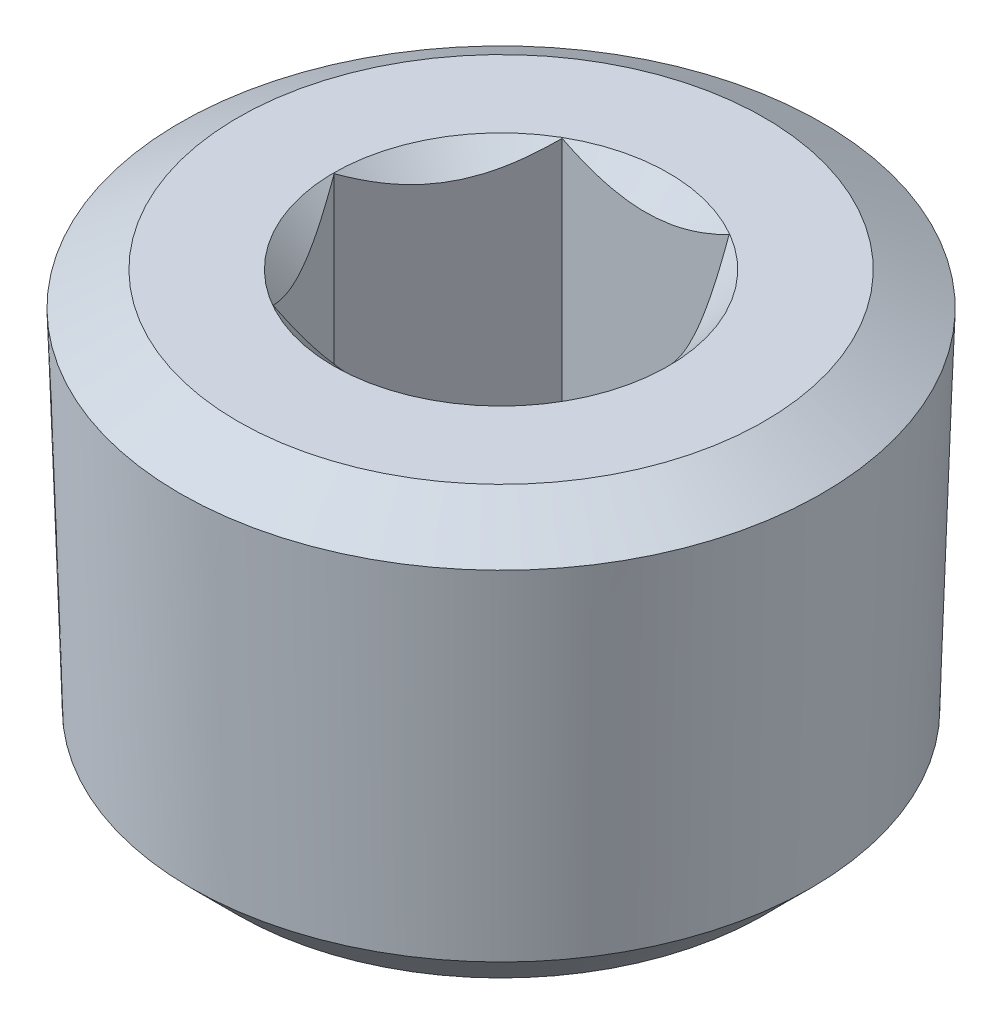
ISO-10303-21;
HEADER;
FILE_DESCRIPTION(('STEP AP214'),'2;1');
FILE_NAME('part.step','',(''),(''),'','','');
FILE_SCHEMA(('AUTOMOTIVE_DESIGN { 1 0 10303 214 1 1 1 1 }'));
ENDSEC;
DATA;
#1=APPLICATION_CONTEXT('core data for automotive mechanical design processes');
#2=APPLICATION_PROTOCOL_DEFINITION('international standard','automotive_design',2000,#1);
#3=PRODUCT_CONTEXT('',#1,'mechanical');
#4=PRODUCT('Part','Part','',(#3));
#5=PRODUCT_RELATED_PRODUCT_CATEGORY('part','',(#4));
#6=PRODUCT_DEFINITION_FORMATION('','',#4);
#7=PRODUCT_DEFINITION_CONTEXT('part definition',#1,'design');
#8=PRODUCT_DEFINITION('design','',#6,#7);
#9=PRODUCT_DEFINITION_SHAPE('','',#8);
#10=(LENGTH_UNIT() NAMED_UNIT(*) SI_UNIT(.MILLI.,.METRE.));
#11=(NAMED_UNIT(*) PLANE_ANGLE_UNIT() SI_UNIT($,.RADIAN.));
#12=(NAMED_UNIT(*) SI_UNIT($,.STERADIAN.) SOLID_ANGLE_UNIT());
#13=UNCERTAINTY_MEASURE_WITH_UNIT(LENGTH_MEASURE(1.E-05),#10,'distance_accuracy_value','');
#14=(GEOMETRIC_REPRESENTATION_CONTEXT(3) GLOBAL_UNCERTAINTY_ASSIGNED_CONTEXT((#13)) GLOBAL_UNIT_ASSIGNED_CONTEXT((#10,
#11,#12)) REPRESENTATION_CONTEXT('',''));
#15=CARTESIAN_POINT('',(0.,0.,0.));
#16=DIRECTION('',(0.,0.,1.));
#17=DIRECTION('',(1.,0.,0.));
#18=AXIS2_PLACEMENT_3D('',#15,#16,#17);
#19=CARTESIAN_POINT('',(0.,0.,0.));
#20=DIRECTION('',(0.,1.,0.));
#21=DIRECTION('',(0.,0.,1.));
#22=AXIS2_PLACEMENT_3D('',#19,#20,#21);
#23=PLANE('',#22);
#24=CARTESIAN_POINT('',(0.,0.,0.));
#25=DIRECTION('',(0.,1.,0.));
#26=DIRECTION('',(0.,0.,1.));
#27=AXIS2_PLACEMENT_3D('',#24,#25,#26);
#28=CIRCLE('',#27,5.588);
#29=CARTESIAN_POINT('',(0.,0.,5.588));
#30=VERTEX_POINT('',#29);
#31=EDGE_CURVE('E244',#30,#30,#28,.T.);
#32=ORIENTED_EDGE('',*,*,#31,.F.);
#33=EDGE_LOOP('',(#32));
#34=FACE_BOUND('',#33,.T.);
#35=CARTESIAN_POINT('',(0.,0.,0.));
#36=DIRECTION('',(0.,1.,0.));
#37=DIRECTION('',(0.,0.,1.));
#38=AXIS2_PLACEMENT_3D('',#35,#36,#37);
#39=CIRCLE('',#38,8.78728897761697);
#40=CARTESIAN_POINT('',(0.,0.,8.78728897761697));
#41=VERTEX_POINT('',#40);
#42=EDGE_CURVE('E12',#41,#41,#39,.T.);
#43=ORIENTED_EDGE('',*,*,#42,.T.);
#44=EDGE_LOOP('',(#43));
#45=FACE_BOUND('',#44,.T.);
#46=ADVANCED_FACE('F33',(#34,#45),#23,.T.);
#47=CARTESIAN_POINT('',(0.,0.,0.));
#48=DIRECTION('',(0.,-1.,0.));
#49=DIRECTION('',(0.,0.,-1.));
#50=AXIS2_PLACEMENT_3D('',#47,#48,#49);
#51=CONICAL_SURFACE('',#50,8.78728897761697,1.0471975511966);
#52=CARTESIAN_POINT('',(0.,-1.11702342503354,0.));
#53=DIRECTION('',(0.,1.,0.));
#54=DIRECTION('',(0.,0.,1.));
#55=AXIS2_PLACEMENT_3D('',#52,#53,#54);
#56=CIRCLE('',#55,10.7220303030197);
#57=CARTESIAN_POINT('',(0.,-1.11702342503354,10.7220303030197));
#58=VERTEX_POINT('',#57);
#59=EDGE_CURVE('E40',#58,#58,#56,.T.);
#60=ORIENTED_EDGE('',*,*,#59,.T.);
#61=EDGE_LOOP('',(#60));
#62=FACE_BOUND('',#61,.T.);
#63=ORIENTED_EDGE('',*,*,#42,.F.);
#64=EDGE_LOOP('',(#63));
#65=FACE_BOUND('',#64,.T.);
#66=ADVANCED_FACE('F234',(#62,#65),#51,.T.);
#67=CARTESIAN_POINT('',(0.,-1.11702342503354,0.));
#68=DIRECTION('',(0.,1.,0.));
#69=DIRECTION('',(0.,0.,1.));
#70=AXIS2_PLACEMENT_3D('',#67,#68,#69);
#71=CONICAL_SURFACE('',#70,10.7220303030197,0.0312064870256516);
#72=CARTESIAN_POINT('',(0.,-12.7016929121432,0.));
#73=DIRECTION('',(0.,1.,0.));
#74=DIRECTION('',(0.,0.,1.));
#75=AXIS2_PLACEMENT_3D('',#72,#73,#74);
#76=CIRCLE('',#75,10.3603960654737);
#77=CARTESIAN_POINT('',(0.,-12.7016929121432,10.3603960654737));
#78=VERTEX_POINT('',#77);
#79=EDGE_CURVE('E252',#78,#78,#76,.T.);
#80=ORIENTED_EDGE('',*,*,#79,.T.);
#81=EDGE_LOOP('',(#80));
#82=FACE_BOUND('',#81,.T.);
#83=ORIENTED_EDGE('',*,*,#59,.F.);
#84=EDGE_LOOP('',(#83));
#85=FACE_BOUND('',#84,.T.);
#86=ADVANCED_FACE('F239',(#82,#85),#71,.T.);
#87=CARTESIAN_POINT('',(0.,-12.7016929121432,0.));
#88=DIRECTION('',(0.,1.,0.));
#89=DIRECTION('',(0.,0.,1.));
#90=AXIS2_PLACEMENT_3D('',#87,#88,#89);
#91=CONICAL_SURFACE('',#90,10.3603960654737,0.785398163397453);
#92=CARTESIAN_POINT('',(0.,-14.2748,0.));
#93=DIRECTION('',(0.,1.,0.));
#94=DIRECTION('',(0.,0.,1.));
#95=AXIS2_PLACEMENT_3D('',#92,#93,#94);
#96=CIRCLE('',#95,8.78728897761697);
#97=CARTESIAN_POINT('',(0.,-14.2748,8.78728897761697));
#98=VERTEX_POINT('',#97);
#99=EDGE_CURVE('E248',#98,#98,#96,.T.);
#100=ORIENTED_EDGE('',*,*,#99,.T.);
#101=EDGE_LOOP('',(#100));
#102=FACE_BOUND('',#101,.T.);
#103=ORIENTED_EDGE('',*,*,#79,.F.);
#104=EDGE_LOOP('',(#103));
#105=FACE_BOUND('',#104,.T.);
#106=ADVANCED_FACE('F263',(#102,#105),#91,.T.);
#107=CARTESIAN_POINT('',(-8.78728897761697,-14.2748,0.));
#108=DIRECTION('',(0.,-1.,0.));
#109=DIRECTION('',(0.,0.,-1.));
#110=AXIS2_PLACEMENT_3D('',#107,#108,#109);
#111=PLANE('',#110);
#112=ORIENTED_EDGE('',*,*,#99,.F.);
#113=EDGE_LOOP('',(#112));
#114=FACE_BOUND('',#113,.T.);
#115=ADVANCED_FACE('F177',(#114),#111,.T.);
#116=CARTESIAN_POINT('',(0.,0.,0.));
#117=DIRECTION('',(0.,1.,0.));
#118=DIRECTION('',(0.,0.,1.));
#119=AXIS2_PLACEMENT_3D('',#116,#117,#118);
#120=CONICAL_SURFACE('',#119,5.588,0.785398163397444);
#121=CARTESIAN_POINT('',(-5.82098732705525,1.97336029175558,4.826));
#122=CARTESIAN_POINT('',(-5.68037895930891,1.86513957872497,4.826));
#123=CARTESIAN_POINT('',(-5.53901367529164,1.75788686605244,4.826));
#124=CARTESIAN_POINT('',(-5.25445964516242,1.54575989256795,4.826));
#125=CARTESIAN_POINT('',(-5.11127047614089,1.44088619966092,4.826));
#126=CARTESIAN_POINT('',(-4.82171273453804,1.23321340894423,4.826));
#127=CARTESIAN_POINT('',(-4.67532815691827,1.13043655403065,4.826));
#128=CARTESIAN_POINT('',(-4.3801239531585,0.928453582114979,4.826));
#129=CARTESIAN_POINT('',(-4.23130449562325,0.829247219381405,4.826));
#130=CARTESIAN_POINT('',(-3.92127070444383,0.62905260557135,4.826));
#131=CARTESIAN_POINT('',(-3.75986976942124,0.528351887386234,4.826));
#132=CARTESIAN_POINT('',(-3.43327724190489,0.333192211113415,4.826));
#133=CARTESIAN_POINT('',(-3.26808501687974,0.23873430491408,4.826));
#134=CARTESIAN_POINT('',(-2.93386328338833,0.0580712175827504,4.826));
#135=CARTESIAN_POINT('',(-2.76484697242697,-0.0281581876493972,4.826));
#136=CARTESIAN_POINT('',(-2.42203255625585,-0.190432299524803,4.826));
#137=CARTESIAN_POINT('',(-2.24823675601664,-0.26648181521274,4.826));
#138=CARTESIAN_POINT('',(-1.9129593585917,-0.398742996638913,4.826));
#139=CARTESIAN_POINT('',(-1.75196353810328,-0.456173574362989,4.826));
#140=CARTESIAN_POINT('',(-1.42586489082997,-0.558148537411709,4.826));
#141=CARTESIAN_POINT('',(-1.26076180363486,-0.602692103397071,4.826));
#142=CARTESIAN_POINT('',(-0.930313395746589,-0.675737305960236,4.826));
#143=CARTESIAN_POINT('',(-0.765033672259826,-0.704530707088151,4.826));
#144=CARTESIAN_POINT('',(-0.432413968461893,-0.745473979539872,4.826));
#145=CARTESIAN_POINT('',(-0.265074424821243,-0.757627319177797,4.826));
#146=CARTESIAN_POINT('',(0.0626058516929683,-0.764252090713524,4.826));
#147=CARTESIAN_POINT('',(0.222931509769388,-0.759475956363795,4.826));
#148=CARTESIAN_POINT('',(0.54233450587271,-0.73423422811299,4.826));
#149=CARTESIAN_POINT('',(0.701411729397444,-0.71376721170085,4.826));
#150=CARTESIAN_POINT('',(1.01986275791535,-0.65795407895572,4.826));
#151=CARTESIAN_POINT('',(1.17918969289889,-0.622345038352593,4.826));
#152=CARTESIAN_POINT('',(1.49433390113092,-0.538225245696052,4.826));
#153=CARTESIAN_POINT('',(1.65015137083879,-0.489715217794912,4.826));
#154=CARTESIAN_POINT('',(1.96673903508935,-0.378863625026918,4.826));
#155=CARTESIAN_POINT('',(2.12728598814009,-0.315891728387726,4.826));
#156=CARTESIAN_POINT('',(2.44425109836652,-0.18021804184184,4.826));
#157=CARTESIAN_POINT('',(2.60066735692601,-0.107511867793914,4.826));
#158=CARTESIAN_POINT('',(2.91010924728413,0.0459062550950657,4.826));
#159=CARTESIAN_POINT('',(3.06312255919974,0.12664285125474,4.826));
#160=CARTESIAN_POINT('',(3.36564324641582,0.294345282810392,4.826));
#161=CARTESIAN_POINT('',(3.51515115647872,0.381310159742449,4.826));
#162=CARTESIAN_POINT('',(3.80381290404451,0.555835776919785,4.826));
#163=CARTESIAN_POINT('',(3.94311348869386,0.643155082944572,4.826));
#164=CARTESIAN_POINT('',(4.21932134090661,0.821511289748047,4.826));
#165=CARTESIAN_POINT('',(4.35622842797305,0.912548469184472,4.826));
#166=CARTESIAN_POINT('',(4.62686190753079,1.0969365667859,4.826));
#167=CARTESIAN_POINT('',(4.76060501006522,1.19026304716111,4.826));
#168=CARTESIAN_POINT('',(5.02625631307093,1.37941840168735,4.826));
#169=CARTESIAN_POINT('',(5.15816500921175,1.47524657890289,4.826));
#170=CARTESIAN_POINT('',(5.28930417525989,1.57209878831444,4.826));
#171=B_SPLINE_CURVE_WITH_KNOTS('',3,(#121,#122,#123,#124,#125,#126,#127,#128,#129,#130,#131,
#132,#133,#134,#135,#136,#137,#138,#139,#140,#141,#142,#143,#144,#145,#146,#147,#148,#149,#150,
#151,#152,#153,#154,#155,#156,#157,#158,#159,#160,#161,#162,#163,#164,#165,#166,#167,#168,#169,
#170),.UNSPECIFIED.,.F.,.F.,(4,2,2,2,2,2,2,2,2,2,2,2,2,2,2,2,2,2,2,2,2,2,2,2,4),(0.,
0.532308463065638,1.06474268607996,1.60128394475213,2.13778820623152,2.70839310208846,
3.27909389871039,3.84805911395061,4.41675459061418,4.92911037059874,5.44149871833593,
5.94404277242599,6.44648206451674,6.92687576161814,7.40731301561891,7.89645698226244,
8.38557349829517,8.90254275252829,9.41974562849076,9.93858801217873,10.4573507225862,
10.9504993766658,11.4436850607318,11.932911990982,12.4220040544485),.UNSPECIFIED.);
#172=CARTESIAN_POINT('',(2.78629239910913,-0.0154152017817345,4.826));
#173=VERTEX_POINT('',#172);
#174=CARTESIAN_POINT('',(-2.78629239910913,-0.0154152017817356,4.826));
#175=VERTEX_POINT('',#174);
#176=EDGE_CURVE('E47',#173,#175,#171,.F.);
#177=ORIENTED_EDGE('',*,*,#176,.T.);
#178=CARTESIAN_POINT('',(-2.78617692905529,-0.0152997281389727,4.8262));
#179=CARTESIAN_POINT('',(-2.83408610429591,-0.0632046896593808,4.74321887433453));
#180=CARTESIAN_POINT('',(-2.88236353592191,-0.109639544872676,4.65959990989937));
#181=CARTESIAN_POINT('',(-2.97972716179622,-0.199121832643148,4.49096116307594));
#182=CARTESIAN_POINT('',(-3.02881378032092,-0.242167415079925,4.4059406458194));
#183=CARTESIAN_POINT('',(-3.17785183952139,-0.365916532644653,4.14779915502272));
#184=CARTESIAN_POINT('',(-3.27906498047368,-0.440704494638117,3.97249285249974));
#185=CARTESIAN_POINT('',(-3.48316938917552,-0.568773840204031,3.61897364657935));
#186=CARTESIAN_POINT('',(-3.58600848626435,-0.622377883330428,3.44085110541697));
#187=CARTESIAN_POINT('',(-3.74195789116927,-0.684384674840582,3.17073881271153));
#188=CARTESIAN_POINT('',(-3.794170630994,-0.701978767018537,3.08030369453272));
#189=CARTESIAN_POINT('',(-3.8990382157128,-0.730635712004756,2.89866770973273));
#190=CARTESIAN_POINT('',(-3.95169299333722,-0.741699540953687,2.80746695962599));
#191=CARTESIAN_POINT('',(-4.08000416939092,-0.760249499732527,2.58522548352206));
#192=CARTESIAN_POINT('',(-4.15579881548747,-0.764141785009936,2.45394530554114));
#193=CARTESIAN_POINT('',(-4.30725151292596,-0.757609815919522,2.19162153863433));
#194=CARTESIAN_POINT('',(-4.38290950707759,-0.747180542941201,2.06057804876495));
#195=CARTESIAN_POINT('',(-4.53351221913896,-0.712620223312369,1.79972649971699));
#196=CARTESIAN_POINT('',(-4.60845604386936,-0.688473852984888,1.66991998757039));
#197=CARTESIAN_POINT('',(-4.75705559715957,-0.627792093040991,1.41253801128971));
#198=CARTESIAN_POINT('',(-4.8307114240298,-0.591257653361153,1.28496237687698));
#199=CARTESIAN_POINT('',(-4.96146614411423,-0.51609361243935,1.0584885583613));
#200=CARTESIAN_POINT('',(-5.01885452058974,-0.479440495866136,0.959088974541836));
#201=CARTESIAN_POINT('',(-5.13260104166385,-0.40022749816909,0.762074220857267));
#202=CARTESIAN_POINT('',(-5.18895915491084,-0.357667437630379,0.664459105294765));
#203=CARTESIAN_POINT('',(-5.30046764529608,-0.267594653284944,0.471320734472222));
#204=CARTESIAN_POINT('',(-5.35562119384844,-0.220097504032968,0.375791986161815));
#205=CARTESIAN_POINT('',(-5.46490695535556,-0.120774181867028,0.186503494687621));
#206=CARTESIAN_POINT('',(-5.5190397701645,-0.0689506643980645,0.0927427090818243));
#207=CARTESIAN_POINT('',(-5.5727002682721,-0.0152997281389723,-0.00019999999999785));
#208=B_SPLINE_CURVE_WITH_KNOTS('',3,(#178,#179,#180,#181,#182,#183,#184,#185,#186,#187,#188,
#189,#190,#191,#192,#193,#194,#195,#196,#197,#198,#199,#200,#201,#202,#203,#204,#205,#206,#207),
.UNSPECIFIED.,.F.,.F.,(4,2,2,2,2,2,2,2,2,2,2,2,2,2,4),(0.,0.321360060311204,0.642894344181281,
1.28943446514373,1.92570770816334,2.24322028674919,2.56068539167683,3.01489632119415,
3.46926645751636,3.9241451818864,4.37898903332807,4.74028088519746,5.10158371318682,
5.46177950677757,5.82175582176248),.UNSPECIFIED.);
#209=CARTESIAN_POINT('',(-5.57258479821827,-0.0154152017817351,0.));
#210=VERTEX_POINT('',#209);
#211=EDGE_CURVE('E119',#175,#210,#208,.T.);
#212=ORIENTED_EDGE('',*,*,#211,.T.);
#213=CARTESIAN_POINT('',(-5.5727002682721,-0.0152997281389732,0.000200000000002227));
#214=CARTESIAN_POINT('',(-5.52479109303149,-0.063204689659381,-0.0827811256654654));
#215=CARTESIAN_POINT('',(-5.47651366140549,-0.109639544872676,-0.16640009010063));
#216=CARTESIAN_POINT('',(-5.37915003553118,-0.199121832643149,-0.335038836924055));
#217=CARTESIAN_POINT('',(-5.33006341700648,-0.242167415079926,-0.420059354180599));
#218=CARTESIAN_POINT('',(-5.18102535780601,-0.365916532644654,-0.678200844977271));
#219=CARTESIAN_POINT('',(-5.07981221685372,-0.440704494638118,-0.853507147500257));
#220=CARTESIAN_POINT('',(-4.87570780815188,-0.568773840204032,-1.20702635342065));
#221=CARTESIAN_POINT('',(-4.77286871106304,-0.622377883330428,-1.38514889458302));
#222=CARTESIAN_POINT('',(-4.61691930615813,-0.684384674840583,-1.65526118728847));
#223=CARTESIAN_POINT('',(-4.56470656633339,-0.701978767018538,-1.74569630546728));
#224=CARTESIAN_POINT('',(-4.4598389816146,-0.730635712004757,-1.92733229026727));
#225=CARTESIAN_POINT('',(-4.40718420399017,-0.741699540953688,-2.01853304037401));
#226=CARTESIAN_POINT('',(-4.27887302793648,-0.760249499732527,-2.24077451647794));
#227=CARTESIAN_POINT('',(-4.20307838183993,-0.764141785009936,-2.37205469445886));
#228=CARTESIAN_POINT('',(-4.05162568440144,-0.757609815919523,-2.63437846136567));
#229=CARTESIAN_POINT('',(-3.97596769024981,-0.747180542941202,-2.76542195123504));
#230=CARTESIAN_POINT('',(-3.82536497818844,-0.71262022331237,-3.02627350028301));
#231=CARTESIAN_POINT('',(-3.75042115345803,-0.688473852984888,-3.15608001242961));
#232=CARTESIAN_POINT('',(-3.60182160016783,-0.627792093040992,-3.41346198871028));
#233=CARTESIAN_POINT('',(-3.5281657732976,-0.591257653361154,-3.54103762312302));
#234=CARTESIAN_POINT('',(-3.39741105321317,-0.516093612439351,-3.7675114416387));
#235=CARTESIAN_POINT('',(-3.34002267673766,-0.479440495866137,-3.86691102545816));
#236=CARTESIAN_POINT('',(-3.22627615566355,-0.400227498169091,-4.06392577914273));
#237=CARTESIAN_POINT('',(-3.16991804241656,-0.35766743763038,-4.16154089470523));
#238=CARTESIAN_POINT('',(-3.05840955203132,-0.267594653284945,-4.35467926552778));
#239=CARTESIAN_POINT('',(-3.00325600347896,-0.220097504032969,-4.45020801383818));
#240=CARTESIAN_POINT('',(-2.89397024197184,-0.12077418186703,-4.63949650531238));
#241=CARTESIAN_POINT('',(-2.8398374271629,-0.0689506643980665,-4.73325729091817));
#242=CARTESIAN_POINT('',(-2.7861769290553,-0.0152997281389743,-4.8262));
#243=B_SPLINE_CURVE_WITH_KNOTS('',3,(#213,#214,#215,#216,#217,#218,#219,#220,#221,#222,#223,
#224,#225,#226,#227,#228,#229,#230,#231,#232,#233,#234,#235,#236,#237,#238,#239,#240,#241,#242),
.UNSPECIFIED.,.F.,.F.,(4,2,2,2,2,2,2,2,2,2,2,2,2,2,4),(0.,0.321360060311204,0.642894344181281,
1.28943446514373,1.92570770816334,2.2432202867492,2.56068539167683,3.01489632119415,
3.46926645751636,3.92414518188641,4.37898903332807,4.74028088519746,5.10158371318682,
5.46177950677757,5.82175582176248),.UNSPECIFIED.);
#244=CARTESIAN_POINT('',(-2.78629239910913,-0.0154152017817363,-4.826));
#245=VERTEX_POINT('',#244);
#246=EDGE_CURVE('E201',#210,#245,#243,.T.);
#247=ORIENTED_EDGE('',*,*,#246,.T.);
#248=CARTESIAN_POINT('',(-5.82098732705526,1.97336029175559,-4.826));
#249=CARTESIAN_POINT('',(-5.68037895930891,1.86513957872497,-4.826));
#250=CARTESIAN_POINT('',(-5.53901367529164,1.75788686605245,-4.826));
#251=CARTESIAN_POINT('',(-5.25445964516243,1.54575989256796,-4.826));
#252=CARTESIAN_POINT('',(-5.11127047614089,1.44088619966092,-4.826));
#253=CARTESIAN_POINT('',(-4.82171273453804,1.23321340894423,-4.826));
#254=CARTESIAN_POINT('',(-4.67532815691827,1.13043655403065,-4.826));
#255=CARTESIAN_POINT('',(-4.3801239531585,0.928453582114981,-4.826));
#256=CARTESIAN_POINT('',(-4.23130449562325,0.829247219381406,-4.826));
#257=CARTESIAN_POINT('',(-3.92127070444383,0.629052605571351,-4.826));
#258=CARTESIAN_POINT('',(-3.75986976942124,0.528351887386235,-4.826));
#259=CARTESIAN_POINT('',(-3.43327724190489,0.333192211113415,-4.826));
#260=CARTESIAN_POINT('',(-3.26808501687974,0.238734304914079,-4.826));
#261=CARTESIAN_POINT('',(-2.93386328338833,0.0580712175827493,-4.826));
#262=CARTESIAN_POINT('',(-2.76484697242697,-0.028158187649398,-4.826));
#263=CARTESIAN_POINT('',(-2.42203255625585,-0.190432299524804,-4.826));
#264=CARTESIAN_POINT('',(-2.24823675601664,-0.266481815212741,-4.826));
#265=CARTESIAN_POINT('',(-1.9129593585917,-0.398742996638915,-4.826));
#266=CARTESIAN_POINT('',(-1.75196353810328,-0.45617357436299,-4.826));
#267=CARTESIAN_POINT('',(-1.42586489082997,-0.558148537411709,-4.826));
#268=CARTESIAN_POINT('',(-1.26076180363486,-0.602692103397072,-4.826));
#269=CARTESIAN_POINT('',(-0.930313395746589,-0.675737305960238,-4.826));
#270=CARTESIAN_POINT('',(-0.765033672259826,-0.704530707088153,-4.826));
#271=CARTESIAN_POINT('',(-0.432413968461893,-0.745473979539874,-4.826));
#272=CARTESIAN_POINT('',(-0.265074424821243,-0.757627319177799,-4.826));
#273=CARTESIAN_POINT('',(0.0626058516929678,-0.764252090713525,-4.826));
#274=CARTESIAN_POINT('',(0.222931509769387,-0.759475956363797,-4.826));
#275=CARTESIAN_POINT('',(0.54233450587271,-0.734234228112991,-4.826));
#276=CARTESIAN_POINT('',(0.701411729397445,-0.713767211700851,-4.826));
#277=CARTESIAN_POINT('',(1.01986275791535,-0.65795407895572,-4.826));
#278=CARTESIAN_POINT('',(1.17918969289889,-0.622345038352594,-4.826));
#279=CARTESIAN_POINT('',(1.49433390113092,-0.538225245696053,-4.826));
#280=CARTESIAN_POINT('',(1.65015137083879,-0.489715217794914,-4.826));
#281=CARTESIAN_POINT('',(1.96673903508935,-0.378863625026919,-4.826));
#282=CARTESIAN_POINT('',(2.1272859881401,-0.315891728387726,-4.826));
#283=CARTESIAN_POINT('',(2.44425109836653,-0.18021804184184,-4.826));
#284=CARTESIAN_POINT('',(2.60066735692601,-0.107511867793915,-4.826));
#285=CARTESIAN_POINT('',(2.91010924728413,0.0459062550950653,-4.826));
#286=CARTESIAN_POINT('',(3.06312255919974,0.126642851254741,-4.826));
#287=CARTESIAN_POINT('',(3.36564324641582,0.294345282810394,-4.826));
#288=CARTESIAN_POINT('',(3.51515115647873,0.381310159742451,-4.826));
#289=CARTESIAN_POINT('',(3.80381290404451,0.555835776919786,-4.826));
#290=CARTESIAN_POINT('',(3.94311348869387,0.643155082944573,-4.826));
#291=CARTESIAN_POINT('',(4.21932134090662,0.821511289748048,-4.826));
#292=CARTESIAN_POINT('',(4.35622842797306,0.912548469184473,-4.826));
#293=CARTESIAN_POINT('',(4.6268619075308,1.0969365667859,-4.826));
#294=CARTESIAN_POINT('',(4.76060501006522,1.19026304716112,-4.826));
#295=CARTESIAN_POINT('',(5.02625631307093,1.37941840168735,-4.826));
#296=CARTESIAN_POINT('',(5.15816500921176,1.47524657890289,-4.826));
#297=CARTESIAN_POINT('',(5.28930417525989,1.57209878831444,-4.826));
#298=B_SPLINE_CURVE_WITH_KNOTS('',3,(#248,#249,#250,#251,#252,#253,#254,#255,#256,#257,#258,
#259,#260,#261,#262,#263,#264,#265,#266,#267,#268,#269,#270,#271,#272,#273,#274,#275,#276,#277,
#278,#279,#280,#281,#282,#283,#284,#285,#286,#287,#288,#289,#290,#291,#292,#293,#294,#295,#296,
#297),.UNSPECIFIED.,.F.,.F.,(4,2,2,2,2,2,2,2,2,2,2,2,2,2,2,2,2,2,2,2,2,2,2,2,4),(0.,
0.532308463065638,1.06474268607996,1.60128394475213,2.13778820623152,2.70839310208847,
3.27909389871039,3.84805911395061,4.41675459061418,4.92911037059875,5.44149871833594,
5.944042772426,6.44648206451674,6.92687576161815,7.40731301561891,7.89645698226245,
8.38557349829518,8.9025427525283,9.41974562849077,9.93858801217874,10.4573507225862,
10.9504993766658,11.4436850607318,11.932911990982,12.4220040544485),.UNSPECIFIED.);
#299=CARTESIAN_POINT('',(2.78629239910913,-0.0154152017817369,-4.826));
#300=VERTEX_POINT('',#299);
#301=EDGE_CURVE('E194',#245,#300,#298,.T.);
#302=ORIENTED_EDGE('',*,*,#301,.T.);
#303=CARTESIAN_POINT('',(2.78617692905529,-0.0152997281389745,-4.8262));
#304=CARTESIAN_POINT('',(2.83408610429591,-0.0632046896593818,-4.74321887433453));
#305=CARTESIAN_POINT('',(2.88236353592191,-0.109639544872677,-4.65959990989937));
#306=CARTESIAN_POINT('',(2.97972716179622,-0.19912183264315,-4.49096116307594));
#307=CARTESIAN_POINT('',(3.02881378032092,-0.242167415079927,-4.4059406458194));
#308=CARTESIAN_POINT('',(3.17785183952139,-0.365916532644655,-4.14779915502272));
#309=CARTESIAN_POINT('',(3.27906498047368,-0.440704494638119,-3.97249285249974));
#310=CARTESIAN_POINT('',(3.48316938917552,-0.568773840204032,-3.61897364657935));
#311=CARTESIAN_POINT('',(3.58600848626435,-0.622377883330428,-3.44085110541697));
#312=CARTESIAN_POINT('',(3.74195789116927,-0.684384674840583,-3.17073881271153));
#313=CARTESIAN_POINT('',(3.794170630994,-0.701978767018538,-3.08030369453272));
#314=CARTESIAN_POINT('',(3.8990382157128,-0.730635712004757,-2.89866770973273));
#315=CARTESIAN_POINT('',(3.95169299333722,-0.741699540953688,-2.80746695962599));
#316=CARTESIAN_POINT('',(4.08000416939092,-0.760249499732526,-2.58522548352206));
#317=CARTESIAN_POINT('',(4.15579881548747,-0.764141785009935,-2.45394530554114));
#318=CARTESIAN_POINT('',(4.30725151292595,-0.757609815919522,-2.19162153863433));
#319=CARTESIAN_POINT('',(4.38290950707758,-0.747180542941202,-2.06057804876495));
#320=CARTESIAN_POINT('',(4.53351221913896,-0.71262022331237,-1.79972649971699));
#321=CARTESIAN_POINT('',(4.60845604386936,-0.688473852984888,-1.66991998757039));
#322=CARTESIAN_POINT('',(4.75705559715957,-0.627792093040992,-1.41253801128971));
#323=CARTESIAN_POINT('',(4.8307114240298,-0.591257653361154,-1.28496237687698));
#324=CARTESIAN_POINT('',(4.96146614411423,-0.516093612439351,-1.0584885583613));
#325=CARTESIAN_POINT('',(5.01885452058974,-0.479440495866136,-0.959088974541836));
#326=CARTESIAN_POINT('',(5.13260104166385,-0.40022749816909,-0.762074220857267));
#327=CARTESIAN_POINT('',(5.18895915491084,-0.357667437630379,-0.664459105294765));
#328=CARTESIAN_POINT('',(5.30046764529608,-0.267594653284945,-0.471320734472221));
#329=CARTESIAN_POINT('',(5.35562119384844,-0.220097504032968,-0.375791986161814));
#330=CARTESIAN_POINT('',(5.46490695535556,-0.120774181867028,-0.186503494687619));
#331=CARTESIAN_POINT('',(5.5190397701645,-0.0689506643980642,-0.0927427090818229));
#332=CARTESIAN_POINT('',(5.5727002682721,-0.0152997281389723,0.000199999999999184));
#333=B_SPLINE_CURVE_WITH_KNOTS('',3,(#303,#304,#305,#306,#307,#308,#309,#310,#311,#312,#313,
#314,#315,#316,#317,#318,#319,#320,#321,#322,#323,#324,#325,#326,#327,#328,#329,#330,#331,#332),
.UNSPECIFIED.,.F.,.F.,(4,2,2,2,2,2,2,2,2,2,2,2,2,2,4),(0.,0.321360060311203,0.642894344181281,
1.28943446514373,1.92570770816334,2.24322028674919,2.56068539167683,3.01489632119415,
3.46926645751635,3.9241451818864,4.37898903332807,4.74028088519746,5.10158371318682,
5.46177950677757,5.82175582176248),.UNSPECIFIED.);
#334=CARTESIAN_POINT('',(5.57258479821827,-0.0154152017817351,0.));
#335=VERTEX_POINT('',#334);
#336=EDGE_CURVE('E187',#300,#335,#333,.T.);
#337=ORIENTED_EDGE('',*,*,#336,.T.);
#338=CARTESIAN_POINT('',(5.5727002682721,-0.0152997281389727,-0.000200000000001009));
#339=CARTESIAN_POINT('',(5.52479109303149,-0.0632046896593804,0.0827811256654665));
#340=CARTESIAN_POINT('',(5.47651366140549,-0.109639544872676,0.166400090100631));
#341=CARTESIAN_POINT('',(5.37915003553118,-0.199121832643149,0.335038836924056));
#342=CARTESIAN_POINT('',(5.33006341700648,-0.242167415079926,0.4200593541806));
#343=CARTESIAN_POINT('',(5.18102535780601,-0.365916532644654,0.678200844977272));
#344=CARTESIAN_POINT('',(5.07981221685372,-0.440704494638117,0.853507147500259));
#345=CARTESIAN_POINT('',(4.87570780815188,-0.56877384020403,1.20702635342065));
#346=CARTESIAN_POINT('',(4.77286871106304,-0.622377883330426,1.38514889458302));
#347=CARTESIAN_POINT('',(4.61691930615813,-0.684384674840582,1.65526118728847));
#348=CARTESIAN_POINT('',(4.5647065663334,-0.701978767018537,1.74569630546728));
#349=CARTESIAN_POINT('',(4.4598389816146,-0.730635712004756,1.92733229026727));
#350=CARTESIAN_POINT('',(4.40718420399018,-0.741699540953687,2.01853304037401));
#351=CARTESIAN_POINT('',(4.27887302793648,-0.760249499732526,2.24077451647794));
#352=CARTESIAN_POINT('',(4.20307838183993,-0.764141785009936,2.37205469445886));
#353=CARTESIAN_POINT('',(4.05162568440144,-0.757609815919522,2.63437846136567));
#354=CARTESIAN_POINT('',(3.97596769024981,-0.747180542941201,2.76542195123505));
#355=CARTESIAN_POINT('',(3.82536497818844,-0.712620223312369,3.02627350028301));
#356=CARTESIAN_POINT('',(3.75042115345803,-0.688473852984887,3.15608001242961));
#357=CARTESIAN_POINT('',(3.60182160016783,-0.627792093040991,3.41346198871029));
#358=CARTESIAN_POINT('',(3.5281657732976,-0.591257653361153,3.54103762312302));
#359=CARTESIAN_POINT('',(3.39741105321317,-0.51609361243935,3.7675114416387));
#360=CARTESIAN_POINT('',(3.34002267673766,-0.479440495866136,3.86691102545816));
#361=CARTESIAN_POINT('',(3.22627615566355,-0.40022749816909,4.06392577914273));
#362=CARTESIAN_POINT('',(3.16991804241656,-0.357667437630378,4.16154089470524));
#363=CARTESIAN_POINT('',(3.05840955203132,-0.267594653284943,4.35467926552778));
#364=CARTESIAN_POINT('',(3.00325600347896,-0.220097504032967,4.45020801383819));
#365=CARTESIAN_POINT('',(2.89397024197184,-0.120774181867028,4.63949650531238));
#366=CARTESIAN_POINT('',(2.8398374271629,-0.0689506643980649,4.73325729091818));
#367=CARTESIAN_POINT('',(2.7861769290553,-0.0152997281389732,4.8262));
#368=B_SPLINE_CURVE_WITH_KNOTS('',3,(#338,#339,#340,#341,#342,#343,#344,#345,#346,#347,#348,
#349,#350,#351,#352,#353,#354,#355,#356,#357,#358,#359,#360,#361,#362,#363,#364,#365,#366,#367),
.UNSPECIFIED.,.F.,.F.,(4,2,2,2,2,2,2,2,2,2,2,2,2,2,4),(0.,0.321360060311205,0.642894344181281,
1.28943446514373,1.92570770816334,2.24322028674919,2.56068539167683,3.01489632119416,
3.46926645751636,3.92414518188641,4.37898903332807,4.74028088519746,5.10158371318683,
5.46177950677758,5.82175582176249),.UNSPECIFIED.);
#369=EDGE_CURVE('E163',#335,#173,#368,.T.);
#370=ORIENTED_EDGE('',*,*,#369,.T.);
#371=EDGE_LOOP('',(#177,#212,#247,#302,#337,#370));
#372=FACE_BOUND('',#371,.T.);
#373=ORIENTED_EDGE('',*,*,#31,.T.);
#374=EDGE_LOOP('',(#373));
#375=FACE_BOUND('',#374,.T.);
#376=ADVANCED_FACE('F172',(#372,#375),#120,.F.);
#377=CARTESIAN_POINT('',(-5.57258479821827,-8.89,0.));
#378=DIRECTION('',(-0.866025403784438,0.,0.5));
#379=DIRECTION('',(0.5,0.,0.866025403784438));
#380=AXIS2_PLACEMENT_3D('',#377,#378,#379);
#381=PLANE('',#380);
#382=DIRECTION('',(0.,1.,0.));
#383=VECTOR('',#382,1.);
#384=CARTESIAN_POINT('',(-2.78629239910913,-8.89,4.826));
#385=LINE('',#384,#383);
#386=CARTESIAN_POINT('',(-2.78629239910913,-8.89,4.826));
#387=VERTEX_POINT('',#386);
#388=EDGE_CURVE('E116',#387,#175,#385,.T.);
#389=ORIENTED_EDGE('',*,*,#388,.F.);
#390=DIRECTION('',(0.5,0.,0.866025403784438));
#391=VECTOR('',#390,1.);
#392=CARTESIAN_POINT('',(-5.57258479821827,-8.89,0.));
#393=LINE('',#392,#391);
#394=CARTESIAN_POINT('',(-4.1794385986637,-8.89,2.413));
#395=VERTEX_POINT('',#394);
#396=EDGE_CURVE('E103',#395,#387,#393,.T.);
#397=ORIENTED_EDGE('',*,*,#396,.F.);
#398=CARTESIAN_POINT('',(-5.57258479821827,-8.89,0.));
#399=VERTEX_POINT('',#398);
#400=EDGE_CURVE('E113',#399,#395,#393,.T.);
#401=ORIENTED_EDGE('',*,*,#400,.F.);
#402=DIRECTION('',(0.,1.,0.));
#403=VECTOR('',#402,1.);
#404=CARTESIAN_POINT('',(-5.57258479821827,-8.89,0.));
#405=LINE('',#404,#403);
#406=EDGE_CURVE('E143',#399,#210,#405,.T.);
#407=ORIENTED_EDGE('',*,*,#406,.T.);
#408=ORIENTED_EDGE('',*,*,#211,.F.);
#409=EDGE_LOOP('',(#389,#397,#401,#407,#408));
#410=FACE_BOUND('',#409,.T.);
#411=ADVANCED_FACE('F117',(#410),#381,.F.);
#412=CARTESIAN_POINT('',(-2.78629239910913,-8.89,-4.826));
#413=DIRECTION('',(-0.866025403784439,0.,-0.5));
#414=DIRECTION('',(-0.5,0.,0.866025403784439));
#415=AXIS2_PLACEMENT_3D('',#412,#413,#414);
#416=PLANE('',#415);
#417=ORIENTED_EDGE('',*,*,#406,.F.);
#418=DIRECTION('',(-0.5,0.,0.866025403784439));
#419=VECTOR('',#418,1.);
#420=CARTESIAN_POINT('',(-2.78629239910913,-8.89,-4.826));
#421=LINE('',#420,#419);
#422=CARTESIAN_POINT('',(-4.1794385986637,-8.89,-2.413));
#423=VERTEX_POINT('',#422);
#424=EDGE_CURVE('E140',#423,#399,#421,.T.);
#425=ORIENTED_EDGE('',*,*,#424,.F.);
#426=CARTESIAN_POINT('',(-2.78629239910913,-8.89,-4.826));
#427=VERTEX_POINT('',#426);
#428=EDGE_CURVE('E122',#427,#423,#421,.T.);
#429=ORIENTED_EDGE('',*,*,#428,.F.);
#430=DIRECTION('',(0.,1.,0.));
#431=VECTOR('',#430,1.);
#432=CARTESIAN_POINT('',(-2.78629239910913,-8.89,-4.826));
#433=LINE('',#432,#431);
#434=EDGE_CURVE('E145',#427,#245,#433,.T.);
#435=ORIENTED_EDGE('',*,*,#434,.T.);
#436=ORIENTED_EDGE('',*,*,#246,.F.);
#437=EDGE_LOOP('',(#417,#425,#429,#435,#436));
#438=FACE_BOUND('',#437,.T.);
#439=ADVANCED_FACE('F212',(#438),#416,.F.);
#440=CARTESIAN_POINT('',(2.78629239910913,-8.89,-4.826));
#441=DIRECTION('',(0.,0.,-1.));
#442=DIRECTION('',(-1.,0.,0.));
#443=AXIS2_PLACEMENT_3D('',#440,#441,#442);
#444=PLANE('',#443);
#445=ORIENTED_EDGE('',*,*,#434,.F.);
#446=DIRECTION('',(-1.,0.,0.));
#447=VECTOR('',#446,1.);
#448=CARTESIAN_POINT('',(2.78629239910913,-8.89,-4.826));
#449=LINE('',#448,#447);
#450=CARTESIAN_POINT('',(0.,-8.89,-4.826));
#451=VERTEX_POINT('',#450);
#452=EDGE_CURVE('E136',#451,#427,#449,.T.);
#453=ORIENTED_EDGE('',*,*,#452,.F.);
#454=CARTESIAN_POINT('',(2.78629239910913,-8.89,-4.826));
#455=VERTEX_POINT('',#454);
#456=EDGE_CURVE('E137',#455,#451,#449,.T.);
#457=ORIENTED_EDGE('',*,*,#456,.F.);
#458=DIRECTION('',(0.,1.,0.));
#459=VECTOR('',#458,1.);
#460=CARTESIAN_POINT('',(2.78629239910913,-8.89,-4.826));
#461=LINE('',#460,#459);
#462=EDGE_CURVE('E148',#455,#300,#461,.T.);
#463=ORIENTED_EDGE('',*,*,#462,.T.);
#464=ORIENTED_EDGE('',*,*,#301,.F.);
#465=EDGE_LOOP('',(#445,#453,#457,#463,#464));
#466=FACE_BOUND('',#465,.T.);
#467=ADVANCED_FACE('F216',(#466),#444,.F.);
#468=CARTESIAN_POINT('',(5.57258479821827,-8.89,0.));
#469=DIRECTION('',(0.866025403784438,0.,-0.5));
#470=DIRECTION('',(-0.5,0.,-0.866025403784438));
#471=AXIS2_PLACEMENT_3D('',#468,#469,#470);
#472=PLANE('',#471);
#473=ORIENTED_EDGE('',*,*,#462,.F.);
#474=DIRECTION('',(-0.5,0.,-0.866025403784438));
#475=VECTOR('',#474,1.);
#476=CARTESIAN_POINT('',(5.57258479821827,-8.89,0.));
#477=LINE('',#476,#475);
#478=CARTESIAN_POINT('',(4.1794385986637,-8.89,-2.413));
#479=VERTEX_POINT('',#478);
#480=EDGE_CURVE('E132',#479,#455,#477,.T.);
#481=ORIENTED_EDGE('',*,*,#480,.F.);
#482=CARTESIAN_POINT('',(5.57258479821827,-8.89,0.));
#483=VERTEX_POINT('',#482);
#484=EDGE_CURVE('E133',#483,#479,#477,.T.);
#485=ORIENTED_EDGE('',*,*,#484,.F.);
#486=DIRECTION('',(0.,1.,0.));
#487=VECTOR('',#486,1.);
#488=CARTESIAN_POINT('',(5.57258479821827,-8.89,0.));
#489=LINE('',#488,#487);
#490=EDGE_CURVE('E151',#483,#335,#489,.T.);
#491=ORIENTED_EDGE('',*,*,#490,.T.);
#492=ORIENTED_EDGE('',*,*,#336,.F.);
#493=EDGE_LOOP('',(#473,#481,#485,#491,#492));
#494=FACE_BOUND('',#493,.T.);
#495=ADVANCED_FACE('F220',(#494),#472,.F.);
#496=CARTESIAN_POINT('',(2.78629239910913,-8.89,4.826));
#497=DIRECTION('',(0.866025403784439,0.,0.5));
#498=DIRECTION('',(0.5,0.,-0.866025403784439));
#499=AXIS2_PLACEMENT_3D('',#496,#497,#498);
#500=PLANE('',#499);
#501=ORIENTED_EDGE('',*,*,#490,.F.);
#502=DIRECTION('',(0.5,0.,-0.866025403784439));
#503=VECTOR('',#502,1.);
#504=CARTESIAN_POINT('',(2.78629239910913,-8.89,4.826));
#505=LINE('',#504,#503);
#506=CARTESIAN_POINT('',(4.1794385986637,-8.89,2.413));
#507=VERTEX_POINT('',#506);
#508=EDGE_CURVE('E128',#507,#483,#505,.T.);
#509=ORIENTED_EDGE('',*,*,#508,.F.);
#510=CARTESIAN_POINT('',(2.78629239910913,-8.89,4.826));
#511=VERTEX_POINT('',#510);
#512=EDGE_CURVE('E55',#511,#507,#505,.T.);
#513=ORIENTED_EDGE('',*,*,#512,.F.);
#514=DIRECTION('',(0.,1.,0.));
#515=VECTOR('',#514,1.);
#516=CARTESIAN_POINT('',(2.78629239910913,-8.89,4.826));
#517=LINE('',#516,#515);
#518=EDGE_CURVE('E121',#511,#173,#517,.T.);
#519=ORIENTED_EDGE('',*,*,#518,.T.);
#520=ORIENTED_EDGE('',*,*,#369,.F.);
#521=EDGE_LOOP('',(#501,#509,#513,#519,#520));
#522=FACE_BOUND('',#521,.T.);
#523=ADVANCED_FACE('F224',(#522),#500,.F.);
#524=CARTESIAN_POINT('',(-2.78629239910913,-8.89,4.826));
#525=DIRECTION('',(0.,0.,1.));
#526=DIRECTION('',(1.,0.,0.));
#527=AXIS2_PLACEMENT_3D('',#524,#525,#526);
#528=PLANE('',#527);
#529=ORIENTED_EDGE('',*,*,#518,.F.);
#530=DIRECTION('',(1.,0.,0.));
#531=VECTOR('',#530,1.);
#532=CARTESIAN_POINT('',(-2.78629239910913,-8.89,4.826));
#533=LINE('',#532,#531);
#534=CARTESIAN_POINT('',(0.,-8.89,4.826));
#535=VERTEX_POINT('',#534);
#536=EDGE_CURVE('E127',#535,#511,#533,.T.);
#537=ORIENTED_EDGE('',*,*,#536,.F.);
#538=EDGE_CURVE('E107',#387,#535,#533,.T.);
#539=ORIENTED_EDGE('',*,*,#538,.F.);
#540=ORIENTED_EDGE('',*,*,#388,.T.);
#541=ORIENTED_EDGE('',*,*,#176,.F.);
#542=EDGE_LOOP('',(#529,#537,#539,#540,#541));
#543=FACE_BOUND('',#542,.T.);
#544=ADVANCED_FACE('F126',(#543),#528,.F.);
#545=CARTESIAN_POINT('',(0.,-8.89,0.));
#546=DIRECTION('',(0.,1.,0.));
#547=DIRECTION('',(0.,0.,1.));
#548=AXIS2_PLACEMENT_3D('',#545,#546,#547);
#549=PLANE('',#548);
#550=CARTESIAN_POINT('',(0.,-8.89,0.));
#551=DIRECTION('',(0.,1.,0.));
#552=DIRECTION('',(0.,0.,1.));
#553=AXIS2_PLACEMENT_3D('',#550,#551,#552);
#554=CIRCLE('',#553,4.826);
#555=EDGE_CURVE('E109',#395,#535,#554,.T.);
#556=ORIENTED_EDGE('',*,*,#555,.F.);
#557=ORIENTED_EDGE('',*,*,#396,.T.);
#558=ORIENTED_EDGE('',*,*,#538,.T.);
#559=EDGE_LOOP('',(#556,#557,#558));
#560=FACE_BOUND('',#559,.T.);
#561=ADVANCED_FACE('F105',(#560),#549,.T.);
#562=EDGE_CURVE('E414',#423,#395,#554,.T.);
#563=ORIENTED_EDGE('',*,*,#562,.F.);
#564=ORIENTED_EDGE('',*,*,#424,.T.);
#565=ORIENTED_EDGE('',*,*,#400,.T.);
#566=EDGE_LOOP('',(#563,#564,#565));
#567=FACE_BOUND('',#566,.T.);
#568=ADVANCED_FACE('F320',(#567),#549,.T.);
#569=EDGE_CURVE('E425',#451,#423,#554,.T.);
#570=ORIENTED_EDGE('',*,*,#569,.F.);
#571=ORIENTED_EDGE('',*,*,#452,.T.);
#572=ORIENTED_EDGE('',*,*,#428,.T.);
#573=EDGE_LOOP('',(#570,#571,#572));
#574=FACE_BOUND('',#573,.T.);
#575=ADVANCED_FACE('F329',(#574),#549,.T.);
#576=EDGE_CURVE('E426',#479,#451,#554,.T.);
#577=ORIENTED_EDGE('',*,*,#576,.F.);
#578=ORIENTED_EDGE('',*,*,#480,.T.);
#579=ORIENTED_EDGE('',*,*,#456,.T.);
#580=EDGE_LOOP('',(#577,#578,#579));
#581=FACE_BOUND('',#580,.T.);
#582=ADVANCED_FACE('F338',(#581),#549,.T.);
#583=EDGE_CURVE('E255',#507,#479,#554,.T.);
#584=ORIENTED_EDGE('',*,*,#583,.F.);
#585=ORIENTED_EDGE('',*,*,#508,.T.);
#586=ORIENTED_EDGE('',*,*,#484,.T.);
#587=EDGE_LOOP('',(#584,#585,#586));
#588=FACE_BOUND('',#587,.T.);
#589=ADVANCED_FACE('F347',(#588),#549,.T.);
#590=EDGE_CURVE('E249',#535,#507,#554,.T.);
#591=ORIENTED_EDGE('',*,*,#590,.F.);
#592=ORIENTED_EDGE('',*,*,#536,.T.);
#593=ORIENTED_EDGE('',*,*,#512,.T.);
#594=EDGE_LOOP('',(#591,#592,#593));
#595=FACE_BOUND('',#594,.T.);
#596=ADVANCED_FACE('F321',(#595),#549,.T.);
#597=CARTESIAN_POINT('',(-2.71236505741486,-10.16,0.));
#598=DIRECTION('',(0.,-1.,0.));
#599=DIRECTION('',(0.,0.,-1.));
#600=AXIS2_PLACEMENT_3D('',#597,#598,#599);
#601=PLANE('',#600);
#602=CARTESIAN_POINT('',(0.,-10.16,0.));
#603=DIRECTION('',(0.,1.,0.));
#604=DIRECTION('',(0.,0.,1.));
#605=AXIS2_PLACEMENT_3D('',#602,#603,#604);
#606=CIRCLE('',#605,2.71236505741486);
#607=CARTESIAN_POINT('',(0.,-10.16,2.71236505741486));
#608=VERTEX_POINT('',#607);
#609=EDGE_CURVE('E413',#608,#608,#606,.T.);
#610=ORIENTED_EDGE('',*,*,#609,.T.);
#611=EDGE_LOOP('',(#610));
#612=FACE_BOUND('',#611,.T.);
#613=ADVANCED_FACE('F364',(#612),#601,.F.);
#614=CARTESIAN_POINT('',(0.,-8.89,0.));
#615=DIRECTION('',(0.,1.,0.));
#616=DIRECTION('',(0.,0.,1.));
#617=AXIS2_PLACEMENT_3D('',#614,#615,#616);
#618=CONICAL_SURFACE('',#617,4.826,1.02974425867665);
#619=ORIENTED_EDGE('',*,*,#609,.F.);
#620=EDGE_LOOP('',(#619));
#621=FACE_BOUND('',#620,.T.);
#622=ORIENTED_EDGE('',*,*,#590,.T.);
#623=ORIENTED_EDGE('',*,*,#583,.T.);
#624=ORIENTED_EDGE('',*,*,#576,.T.);
#625=ORIENTED_EDGE('',*,*,#569,.T.);
#626=ORIENTED_EDGE('',*,*,#562,.T.);
#627=ORIENTED_EDGE('',*,*,#555,.T.);
#628=EDGE_LOOP('',(#622,#623,#624,#625,#626,#627));
#629=FACE_BOUND('',#628,.T.);
#630=ADVANCED_FACE('F178',(#621,#629),#618,.F.);
#631=CLOSED_SHELL('',(#46,#66,#86,#106,#115,#376,#411,#439,#467,#495,#523,#544,#561,#568,#575,
#582,#589,#596,#613,#630));
#632=MANIFOLD_SOLID_BREP('B2',#631);
#633=ADVANCED_BREP_SHAPE_REPRESENTATION('',(#18,#632),#14);
#634=SHAPE_DEFINITION_REPRESENTATION(#9,#633);
ENDSEC;
END-ISO-10303-21;
